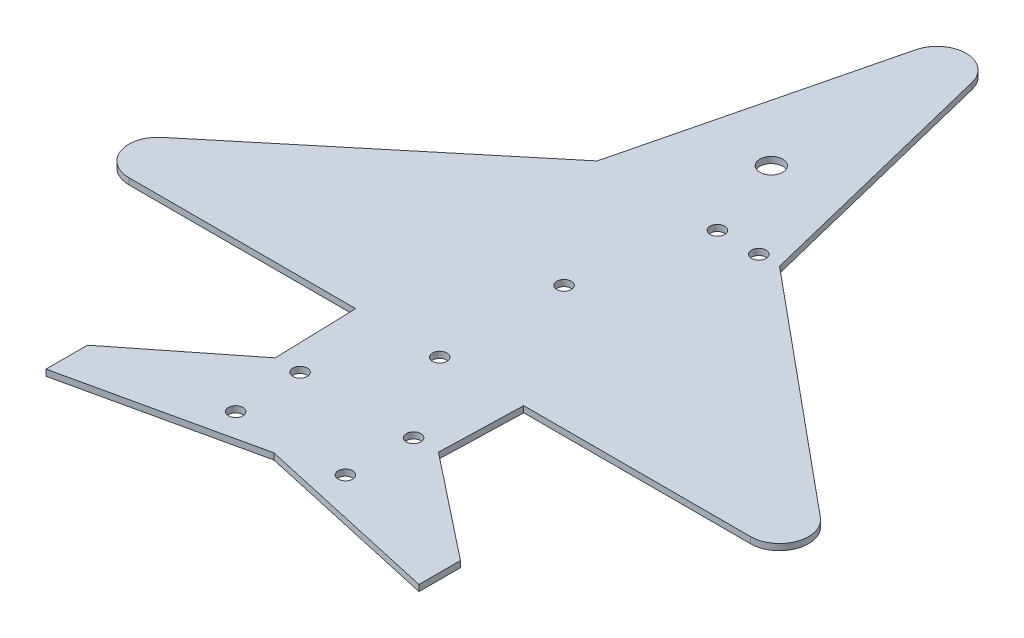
from build123d import *

# Parameters (mm, degrees)
SKETCH2_R           = 1.75
SKETCH2_R_2         = 2.75
BOSS_EXTRUDE1_DEPTH = 1.5


with BuildPart() as part:
    # Sketch2 → Boss-Extrude1 (new body)
    with BuildSketch(Plane(origin=(0, 0, 0), x_dir=(1, 0, 0), z_dir=(0, 1, 0))):
        with BuildLine():
            Line((0, 0), (45, -10))
            Line((45, -10), (45, 0))
            Line((45, 0), (19.697228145, 20))
            Line((19.697228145, 20), (20.272921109, 40))
            Line((20.272921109, 40), (75, 40))
            ThreePointArc((75, 40), (81.585311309, 44.626463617), (79.465850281, 52.390378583))
            Line((79.465850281, 52.390378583), (22, 100))
            Line((22, 100), (6.796545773, 161.675400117))
            ThreePointArc((6.796545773, 161.675400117), (0, 167), (-6.796545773, 161.675400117))
            Line((-6.796545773, 161.675400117), (-22, 100))
            Line((-22, 100), (-79.465850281, 52.390378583))
            ThreePointArc((-79.465850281, 52.390378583), (-81.585311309, 44.626463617), (-75, 40))
            Line((-75, 40), (-20.272921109, 40))
            Line((-20.272921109, 40), (-19.697228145, 20))
            Line((-19.697228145, 20), (-45, 0))
            Line((-45, 0), (-45, -10))
            Line((-45, -10), (0, 0))
        make_face()
        with Locations(Location((13.694742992, 20, 0), (0, 0, 270))):
            Circle(SKETCH2_R, mode=Mode.SUBTRACT)
        with Locations(Location((13.234188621, 4, 0), (0, 0, 270))):
            Circle(SKETCH2_R, mode=Mode.SUBTRACT)
        with Locations(Location((-13.694742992, 20, 0), (0, 0, 90))):
            Circle(SKETCH2_R, mode=Mode.SUBTRACT)
        with Locations(Location((-13.234188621, 4, 0), (0, 0, 90))):
            Circle(SKETCH2_R, mode=Mode.SUBTRACT)
        with Locations(Location((0, 40, 0), (0, 0, 270))):
            Circle(SKETCH2_R, mode=Mode.SUBTRACT)
        with Locations(Location((0, 70, 0), (0, 0, 270))):
            Circle(SKETCH2_R, mode=Mode.SUBTRACT)
        with Locations(Location((0, 120, 0), (0, 0, 270))):
            Circle(SKETCH2_R_2, mode=Mode.SUBTRACT)
        with Locations(Location((7, 100, 0), (0, 0, 270))):
            Circle(SKETCH2_R, mode=Mode.SUBTRACT)
        with Locations(Location((17, 100, 0), (0, 0, 270))):
            Circle(SKETCH2_R, mode=Mode.SUBTRACT)
    extrude(amount=BOSS_EXTRUDE1_DEPTH)


solid = part.part
